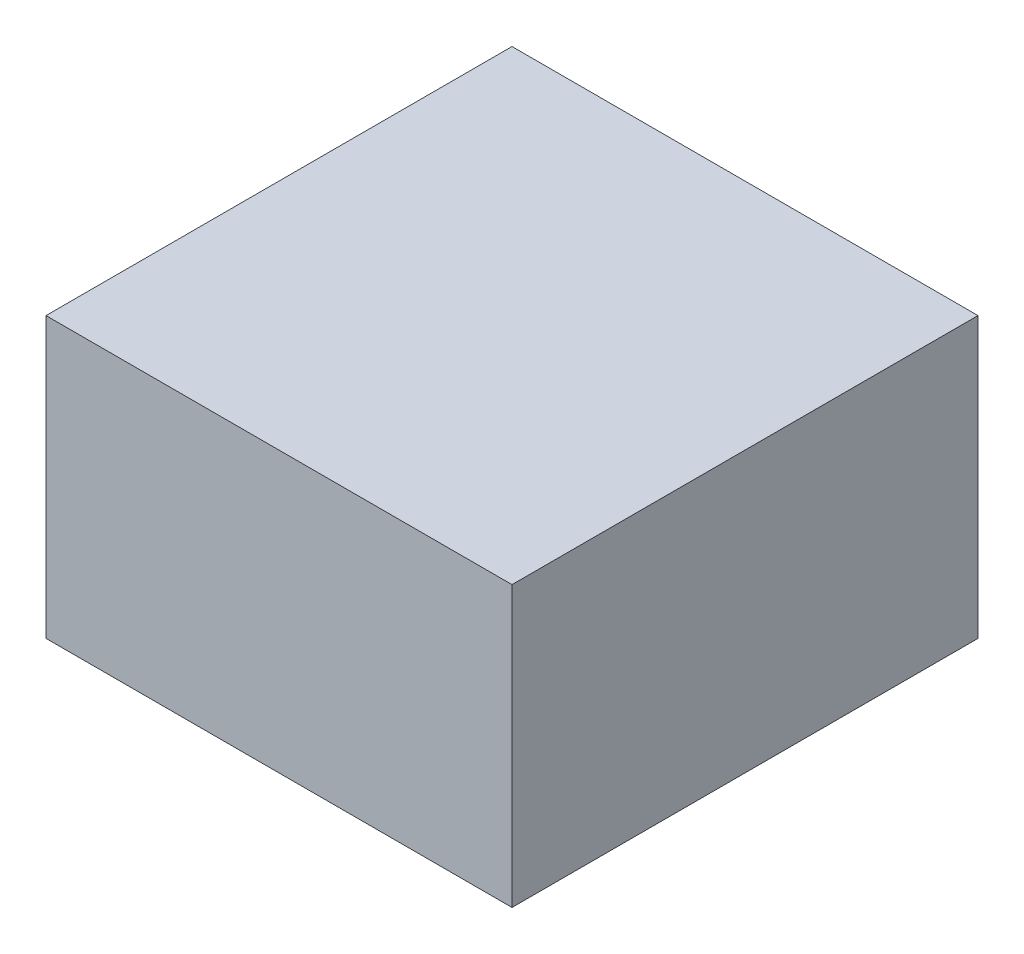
ISO-10303-21;
HEADER;
FILE_DESCRIPTION(('STEP AP214'),'2;1');
FILE_NAME('part.step','',(''),(''),'','','');
FILE_SCHEMA(('AUTOMOTIVE_DESIGN { 1 0 10303 214 1 1 1 1 }'));
ENDSEC;
DATA;
#1=APPLICATION_CONTEXT('core data for automotive mechanical design processes');
#2=APPLICATION_PROTOCOL_DEFINITION('international standard','automotive_design',2000,#1);
#3=PRODUCT_CONTEXT('',#1,'mechanical');
#4=PRODUCT('Part','Part','',(#3));
#5=PRODUCT_RELATED_PRODUCT_CATEGORY('part','',(#4));
#6=PRODUCT_DEFINITION_FORMATION('','',#4);
#7=PRODUCT_DEFINITION_CONTEXT('part definition',#1,'design');
#8=PRODUCT_DEFINITION('design','',#6,#7);
#9=PRODUCT_DEFINITION_SHAPE('','',#8);
#10=(LENGTH_UNIT() NAMED_UNIT(*) SI_UNIT(.MILLI.,.METRE.));
#11=(NAMED_UNIT(*) PLANE_ANGLE_UNIT() SI_UNIT($,.RADIAN.));
#12=(NAMED_UNIT(*) SI_UNIT($,.STERADIAN.) SOLID_ANGLE_UNIT());
#13=UNCERTAINTY_MEASURE_WITH_UNIT(LENGTH_MEASURE(1.E-05),#10,'distance_accuracy_value','');
#14=(GEOMETRIC_REPRESENTATION_CONTEXT(3) GLOBAL_UNCERTAINTY_ASSIGNED_CONTEXT((#13)) GLOBAL_UNIT_ASSIGNED_CONTEXT((#10,
#11,#12)) REPRESENTATION_CONTEXT('',''));
#15=CARTESIAN_POINT('',(0.,0.,0.));
#16=DIRECTION('',(0.,0.,1.));
#17=DIRECTION('',(1.,0.,0.));
#18=AXIS2_PLACEMENT_3D('',#15,#16,#17);
#19=CARTESIAN_POINT('',(0.,0.,30.));
#20=DIRECTION('',(1.,0.,0.));
#21=DIRECTION('',(0.,1.,0.));
#22=AXIS2_PLACEMENT_3D('',#19,#20,#21);
#23=PLANE('',#22);
#24=DIRECTION('',(0.,-1.,0.));
#25=VECTOR('',#24,1.);
#26=CARTESIAN_POINT('',(0.,0.,-30.));
#27=LINE('',#26,#25);
#28=CARTESIAN_POINT('',(0.,36.,-30.));
#29=VERTEX_POINT('',#28);
#30=CARTESIAN_POINT('',(0.,0.,-30.));
#31=VERTEX_POINT('',#30);
#32=EDGE_CURVE('E75',#29,#31,#27,.T.);
#33=ORIENTED_EDGE('',*,*,#32,.T.);
#34=DIRECTION('',(0.,0.,-1.));
#35=VECTOR('',#34,1.);
#36=CARTESIAN_POINT('',(0.,0.,30.));
#37=LINE('',#36,#35);
#38=CARTESIAN_POINT('',(0.,0.,30.));
#39=VERTEX_POINT('',#38);
#40=EDGE_CURVE('E11',#39,#31,#37,.T.);
#41=ORIENTED_EDGE('',*,*,#40,.F.);
#42=DIRECTION('',(0.,-1.,0.));
#43=VECTOR('',#42,1.);
#44=CARTESIAN_POINT('',(0.,0.,30.));
#45=LINE('',#44,#43);
#46=CARTESIAN_POINT('',(0.,36.,30.));
#47=VERTEX_POINT('',#46);
#48=EDGE_CURVE('E93',#47,#39,#45,.T.);
#49=ORIENTED_EDGE('',*,*,#48,.F.);
#50=DIRECTION('',(0.,0.,-1.));
#51=VECTOR('',#50,1.);
#52=CARTESIAN_POINT('',(0.,36.,30.));
#53=LINE('',#52,#51);
#54=EDGE_CURVE('E87',#47,#29,#53,.T.);
#55=ORIENTED_EDGE('',*,*,#54,.T.);
#56=EDGE_LOOP('',(#33,#41,#49,#55));
#57=FACE_BOUND('',#56,.T.);
#58=ADVANCED_FACE('F31',(#57),#23,.F.);
#59=CARTESIAN_POINT('',(0.,0.,30.));
#60=DIRECTION('',(0.,1.,0.));
#61=DIRECTION('',(0.,0.,1.));
#62=AXIS2_PLACEMENT_3D('',#59,#60,#61);
#63=PLANE('',#62);
#64=DIRECTION('',(1.,0.,0.));
#65=VECTOR('',#64,1.);
#66=CARTESIAN_POINT('',(0.,0.,-30.));
#67=LINE('',#66,#65);
#68=CARTESIAN_POINT('',(60.,0.,-30.));
#69=VERTEX_POINT('',#68);
#70=EDGE_CURVE('E71',#31,#69,#67,.T.);
#71=ORIENTED_EDGE('',*,*,#70,.T.);
#72=DIRECTION('',(0.,0.,-1.));
#73=VECTOR('',#72,1.);
#74=CARTESIAN_POINT('',(60.,0.,30.));
#75=LINE('',#74,#73);
#76=CARTESIAN_POINT('',(60.,0.,30.));
#77=VERTEX_POINT('',#76);
#78=EDGE_CURVE('E38',#77,#69,#75,.T.);
#79=ORIENTED_EDGE('',*,*,#78,.F.);
#80=DIRECTION('',(1.,0.,0.));
#81=VECTOR('',#80,1.);
#82=CARTESIAN_POINT('',(0.,0.,30.));
#83=LINE('',#82,#81);
#84=EDGE_CURVE('E83',#39,#77,#83,.T.);
#85=ORIENTED_EDGE('',*,*,#84,.F.);
#86=ORIENTED_EDGE('',*,*,#40,.T.);
#87=EDGE_LOOP('',(#71,#79,#85,#86));
#88=FACE_BOUND('',#87,.T.);
#89=ADVANCED_FACE('F82',(#88),#63,.F.);
#90=CARTESIAN_POINT('',(60.,0.,30.));
#91=DIRECTION('',(-1.,0.,0.));
#92=DIRECTION('',(0.,-1.,0.));
#93=AXIS2_PLACEMENT_3D('',#90,#91,#92);
#94=PLANE('',#93);
#95=DIRECTION('',(0.,1.,0.));
#96=VECTOR('',#95,1.);
#97=CARTESIAN_POINT('',(60.,0.,-30.));
#98=LINE('',#97,#96);
#99=CARTESIAN_POINT('',(60.,36.,-30.));
#100=VERTEX_POINT('',#99);
#101=EDGE_CURVE('E76',#69,#100,#98,.T.);
#102=ORIENTED_EDGE('',*,*,#101,.T.);
#103=DIRECTION('',(0.,0.,-1.));
#104=VECTOR('',#103,1.);
#105=CARTESIAN_POINT('',(60.,36.,30.));
#106=LINE('',#105,#104);
#107=CARTESIAN_POINT('',(60.,36.,30.));
#108=VERTEX_POINT('',#107);
#109=EDGE_CURVE('E99',#108,#100,#106,.T.);
#110=ORIENTED_EDGE('',*,*,#109,.F.);
#111=DIRECTION('',(0.,1.,0.));
#112=VECTOR('',#111,1.);
#113=CARTESIAN_POINT('',(60.,0.,30.));
#114=LINE('',#113,#112);
#115=EDGE_CURVE('E50',#77,#108,#114,.T.);
#116=ORIENTED_EDGE('',*,*,#115,.F.);
#117=ORIENTED_EDGE('',*,*,#78,.T.);
#118=EDGE_LOOP('',(#102,#110,#116,#117));
#119=FACE_BOUND('',#118,.T.);
#120=ADVANCED_FACE('F102',(#119),#94,.F.);
#121=CARTESIAN_POINT('',(0.,36.,30.));
#122=DIRECTION('',(0.,-1.,0.));
#123=DIRECTION('',(0.,0.,-1.));
#124=AXIS2_PLACEMENT_3D('',#121,#122,#123);
#125=PLANE('',#124);
#126=DIRECTION('',(-1.,0.,0.));
#127=VECTOR('',#126,1.);
#128=CARTESIAN_POINT('',(0.,36.,-30.));
#129=LINE('',#128,#127);
#130=EDGE_CURVE('E91',#100,#29,#129,.T.);
#131=ORIENTED_EDGE('',*,*,#130,.T.);
#132=ORIENTED_EDGE('',*,*,#54,.F.);
#133=DIRECTION('',(-1.,0.,0.));
#134=VECTOR('',#133,1.);
#135=CARTESIAN_POINT('',(0.,36.,30.));
#136=LINE('',#135,#134);
#137=EDGE_CURVE('E45',#108,#47,#136,.T.);
#138=ORIENTED_EDGE('',*,*,#137,.F.);
#139=ORIENTED_EDGE('',*,*,#109,.T.);
#140=EDGE_LOOP('',(#131,#132,#138,#139));
#141=FACE_BOUND('',#140,.T.);
#142=ADVANCED_FACE('F104',(#141),#125,.F.);
#143=CARTESIAN_POINT('',(0.,36.,30.));
#144=DIRECTION('',(0.,0.,-1.));
#145=DIRECTION('',(-1.,0.,0.));
#146=AXIS2_PLACEMENT_3D('',#143,#144,#145);
#147=PLANE('',#146);
#148=ORIENTED_EDGE('',*,*,#48,.T.);
#149=ORIENTED_EDGE('',*,*,#84,.T.);
#150=ORIENTED_EDGE('',*,*,#115,.T.);
#151=ORIENTED_EDGE('',*,*,#137,.T.);
#152=EDGE_LOOP('',(#148,#149,#150,#151));
#153=FACE_BOUND('',#152,.T.);
#154=ADVANCED_FACE('F105',(#153),#147,.F.);
#155=CARTESIAN_POINT('',(0.,36.,-30.));
#156=DIRECTION('',(0.,0.,-1.));
#157=DIRECTION('',(-1.,0.,0.));
#158=AXIS2_PLACEMENT_3D('',#155,#156,#157);
#159=PLANE('',#158);
#160=ORIENTED_EDGE('',*,*,#32,.F.);
#161=ORIENTED_EDGE('',*,*,#130,.F.);
#162=ORIENTED_EDGE('',*,*,#101,.F.);
#163=ORIENTED_EDGE('',*,*,#70,.F.);
#164=EDGE_LOOP('',(#160,#161,#162,#163));
#165=FACE_BOUND('',#164,.T.);
#166=ADVANCED_FACE('F72',(#165),#159,.T.);
#167=CLOSED_SHELL('',(#58,#89,#120,#142,#154,#166));
#168=MANIFOLD_SOLID_BREP('B2',#167);
#169=ADVANCED_BREP_SHAPE_REPRESENTATION('',(#18,#168),#14);
#170=SHAPE_DEFINITION_REPRESENTATION(#9,#169);
ENDSEC;
END-ISO-10303-21;
